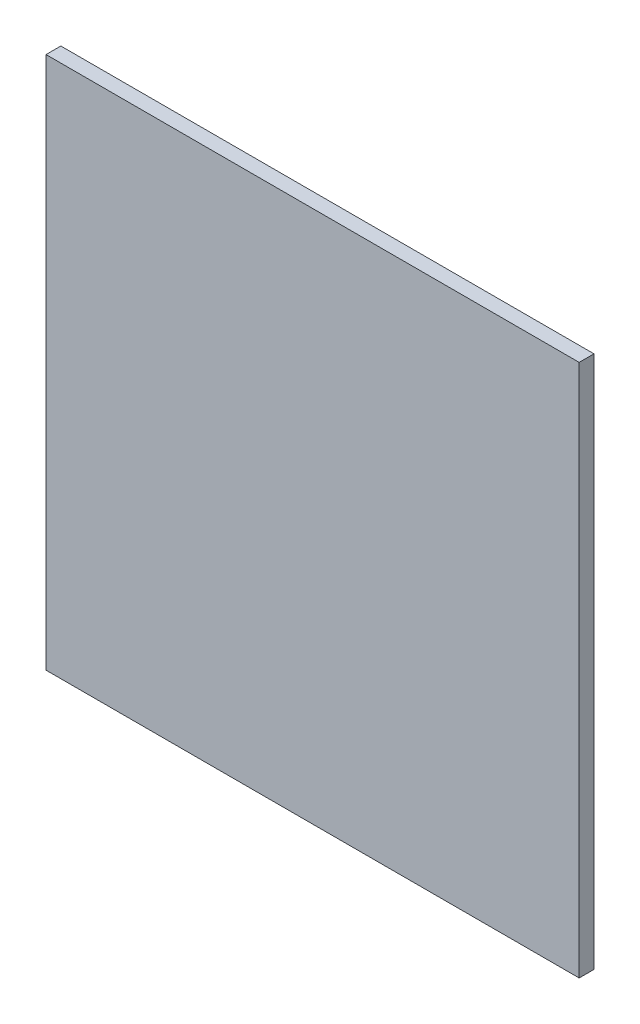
ISO-10303-21;
HEADER;
FILE_DESCRIPTION(('STEP AP214'),'2;1');
FILE_NAME('part.step','',(''),(''),'','','');
FILE_SCHEMA(('AUTOMOTIVE_DESIGN { 1 0 10303 214 1 1 1 1 }'));
ENDSEC;
DATA;
#1=APPLICATION_CONTEXT('core data for automotive mechanical design processes');
#2=APPLICATION_PROTOCOL_DEFINITION('international standard','automotive_design',2000,#1);
#3=PRODUCT_CONTEXT('',#1,'mechanical');
#4=PRODUCT('Part','Part','',(#3));
#5=PRODUCT_RELATED_PRODUCT_CATEGORY('part','',(#4));
#6=PRODUCT_DEFINITION_FORMATION('','',#4);
#7=PRODUCT_DEFINITION_CONTEXT('part definition',#1,'design');
#8=PRODUCT_DEFINITION('design','',#6,#7);
#9=PRODUCT_DEFINITION_SHAPE('','',#8);
#10=(LENGTH_UNIT() NAMED_UNIT(*) SI_UNIT(.MILLI.,.METRE.));
#11=(NAMED_UNIT(*) PLANE_ANGLE_UNIT() SI_UNIT($,.RADIAN.));
#12=(NAMED_UNIT(*) SI_UNIT($,.STERADIAN.) SOLID_ANGLE_UNIT());
#13=UNCERTAINTY_MEASURE_WITH_UNIT(LENGTH_MEASURE(1.E-05),#10,'distance_accuracy_value','');
#14=(GEOMETRIC_REPRESENTATION_CONTEXT(3) GLOBAL_UNCERTAINTY_ASSIGNED_CONTEXT((#13)) GLOBAL_UNIT_ASSIGNED_CONTEXT((#10,
#11,#12)) REPRESENTATION_CONTEXT('',''));
#15=CARTESIAN_POINT('',(0.,0.,0.));
#16=DIRECTION('',(0.,0.,1.));
#17=DIRECTION('',(1.,0.,0.));
#18=AXIS2_PLACEMENT_3D('',#15,#16,#17);
#19=CARTESIAN_POINT('',(-57.15,57.15,1.5875));
#20=DIRECTION('',(0.,0.,1.));
#21=DIRECTION('',(1.,0.,0.));
#22=AXIS2_PLACEMENT_3D('',#19,#20,#21);
#23=PLANE('',#22);
#24=DIRECTION('',(1.,0.,0.));
#25=VECTOR('',#24,1.);
#26=CARTESIAN_POINT('',(57.15,-57.15,1.5875));
#27=LINE('',#26,#25);
#28=CARTESIAN_POINT('',(57.15,-57.15,1.5875));
#29=VERTEX_POINT('',#28);
#30=CARTESIAN_POINT('',(-57.15,-57.15,1.5875));
#31=VERTEX_POINT('',#30);
#32=EDGE_CURVE('E19',#29,#31,#27,.F.);
#33=ORIENTED_EDGE('',*,*,#32,.F.);
#34=DIRECTION('',(0.,1.,0.));
#35=VECTOR('',#34,1.);
#36=CARTESIAN_POINT('',(57.15,57.15,1.5875));
#37=LINE('',#36,#35);
#38=CARTESIAN_POINT('',(57.15,57.15,1.5875));
#39=VERTEX_POINT('',#38);
#40=EDGE_CURVE('E57',#39,#29,#37,.F.);
#41=ORIENTED_EDGE('',*,*,#40,.F.);
#42=DIRECTION('',(1.,0.,0.));
#43=VECTOR('',#42,1.);
#44=CARTESIAN_POINT('',(-57.15,57.15,1.5875));
#45=LINE('',#44,#43);
#46=CARTESIAN_POINT('',(-57.15,57.15,1.5875));
#47=VERTEX_POINT('',#46);
#48=EDGE_CURVE('E52',#47,#39,#45,.T.);
#49=ORIENTED_EDGE('',*,*,#48,.F.);
#50=DIRECTION('',(0.,1.,0.));
#51=VECTOR('',#50,1.);
#52=CARTESIAN_POINT('',(-57.15,-57.15,1.5875));
#53=LINE('',#52,#51);
#54=EDGE_CURVE('E67',#31,#47,#53,.T.);
#55=ORIENTED_EDGE('',*,*,#54,.F.);
#56=EDGE_LOOP('',(#33,#41,#49,#55));
#57=FACE_BOUND('',#56,.T.);
#58=ADVANCED_FACE('F16',(#57),#23,.T.);
#59=CARTESIAN_POINT('',(57.15,-57.15,-1.5875));
#60=DIRECTION('',(0.,-1.,0.));
#61=DIRECTION('',(0.,0.,-1.));
#62=AXIS2_PLACEMENT_3D('',#59,#60,#61);
#63=PLANE('',#62);
#64=DIRECTION('',(1.,0.,0.));
#65=VECTOR('',#64,1.);
#66=CARTESIAN_POINT('',(0.,-57.15,-1.5875));
#67=LINE('',#66,#65);
#68=CARTESIAN_POINT('',(-57.15,-57.15,-1.5875));
#69=VERTEX_POINT('',#68);
#70=CARTESIAN_POINT('',(57.15,-57.15,-1.5875));
#71=VERTEX_POINT('',#70);
#72=EDGE_CURVE('E73',#69,#71,#67,.T.);
#73=ORIENTED_EDGE('',*,*,#72,.T.);
#74=DIRECTION('',(0.,0.,-1.));
#75=VECTOR('',#74,1.);
#76=CARTESIAN_POINT('',(57.15,-57.15,-1.5875));
#77=LINE('',#76,#75);
#78=EDGE_CURVE('E62',#29,#71,#77,.T.);
#79=ORIENTED_EDGE('',*,*,#78,.F.);
#80=ORIENTED_EDGE('',*,*,#32,.T.);
#81=DIRECTION('',(0.,0.,1.));
#82=VECTOR('',#81,1.);
#83=CARTESIAN_POINT('',(-57.15,-57.15,-1.5875));
#84=LINE('',#83,#82);
#85=EDGE_CURVE('E80',#69,#31,#84,.T.);
#86=ORIENTED_EDGE('',*,*,#85,.F.);
#87=EDGE_LOOP('',(#73,#79,#80,#86));
#88=FACE_BOUND('',#87,.T.);
#89=ADVANCED_FACE('F72',(#88),#63,.T.);
#90=CARTESIAN_POINT('',(57.15,57.15,-1.5875));
#91=DIRECTION('',(1.,0.,0.));
#92=DIRECTION('',(0.,0.,-1.));
#93=AXIS2_PLACEMENT_3D('',#90,#91,#92);
#94=PLANE('',#93);
#95=DIRECTION('',(0.,1.,0.));
#96=VECTOR('',#95,1.);
#97=CARTESIAN_POINT('',(57.15,0.,-1.5875));
#98=LINE('',#97,#96);
#99=CARTESIAN_POINT('',(57.15,57.15,-1.5875));
#100=VERTEX_POINT('',#99);
#101=EDGE_CURVE('E83',#71,#100,#98,.T.);
#102=ORIENTED_EDGE('',*,*,#101,.T.);
#103=DIRECTION('',(0.,0.,1.));
#104=VECTOR('',#103,1.);
#105=CARTESIAN_POINT('',(57.15,57.15,-1.5875));
#106=LINE('',#105,#104);
#107=EDGE_CURVE('E64',#39,#100,#106,.F.);
#108=ORIENTED_EDGE('',*,*,#107,.F.);
#109=ORIENTED_EDGE('',*,*,#40,.T.);
#110=ORIENTED_EDGE('',*,*,#78,.T.);
#111=EDGE_LOOP('',(#102,#108,#109,#110));
#112=FACE_BOUND('',#111,.T.);
#113=ADVANCED_FACE('F60',(#112),#94,.T.);
#114=CARTESIAN_POINT('',(-57.15,57.15,-1.5875));
#115=DIRECTION('',(0.,1.,0.));
#116=DIRECTION('',(0.,0.,1.));
#117=AXIS2_PLACEMENT_3D('',#114,#115,#116);
#118=PLANE('',#117);
#119=DIRECTION('',(1.,0.,0.));
#120=VECTOR('',#119,1.);
#121=CARTESIAN_POINT('',(0.,57.15,-1.5875));
#122=LINE('',#121,#120);
#123=CARTESIAN_POINT('',(-57.15,57.15,-1.5875));
#124=VERTEX_POINT('',#123);
#125=EDGE_CURVE('E25',#100,#124,#122,.F.);
#126=ORIENTED_EDGE('',*,*,#125,.T.);
#127=DIRECTION('',(0.,0.,1.));
#128=VECTOR('',#127,1.);
#129=CARTESIAN_POINT('',(-57.15,57.15,-1.5875));
#130=LINE('',#129,#128);
#131=EDGE_CURVE('E33',#47,#124,#130,.F.);
#132=ORIENTED_EDGE('',*,*,#131,.F.);
#133=ORIENTED_EDGE('',*,*,#48,.T.);
#134=ORIENTED_EDGE('',*,*,#107,.T.);
#135=EDGE_LOOP('',(#126,#132,#133,#134));
#136=FACE_BOUND('',#135,.T.);
#137=ADVANCED_FACE('F87',(#136),#118,.T.);
#138=CARTESIAN_POINT('',(-57.15,-57.15,-1.5875));
#139=DIRECTION('',(-1.,0.,0.));
#140=DIRECTION('',(0.,0.,1.));
#141=AXIS2_PLACEMENT_3D('',#138,#139,#140);
#142=PLANE('',#141);
#143=DIRECTION('',(0.,1.,0.));
#144=VECTOR('',#143,1.);
#145=CARTESIAN_POINT('',(-57.15,0.,-1.5875));
#146=LINE('',#145,#144);
#147=EDGE_CURVE('E11',#124,#69,#146,.F.);
#148=ORIENTED_EDGE('',*,*,#147,.T.);
#149=ORIENTED_EDGE('',*,*,#85,.T.);
#150=ORIENTED_EDGE('',*,*,#54,.T.);
#151=ORIENTED_EDGE('',*,*,#131,.T.);
#152=EDGE_LOOP('',(#148,#149,#150,#151));
#153=FACE_BOUND('',#152,.T.);
#154=ADVANCED_FACE('F90',(#153),#142,.T.);
#155=CARTESIAN_POINT('',(0.,0.,-1.5875));
#156=DIRECTION('',(0.,0.,1.));
#157=DIRECTION('',(1.,0.,0.));
#158=AXIS2_PLACEMENT_3D('',#155,#156,#157);
#159=PLANE('',#158);
#160=ORIENTED_EDGE('',*,*,#125,.F.);
#161=ORIENTED_EDGE('',*,*,#101,.F.);
#162=ORIENTED_EDGE('',*,*,#72,.F.);
#163=ORIENTED_EDGE('',*,*,#147,.F.);
#164=EDGE_LOOP('',(#160,#161,#162,#163));
#165=FACE_BOUND('',#164,.T.);
#166=ADVANCED_FACE('F89',(#165),#159,.F.);
#167=CLOSED_SHELL('',(#58,#89,#113,#137,#154,#166));
#168=MANIFOLD_SOLID_BREP('B1',#167);
#169=ADVANCED_BREP_SHAPE_REPRESENTATION('',(#18,#168),#14);
#170=SHAPE_DEFINITION_REPRESENTATION(#9,#169);
ENDSEC;
END-ISO-10303-21;
